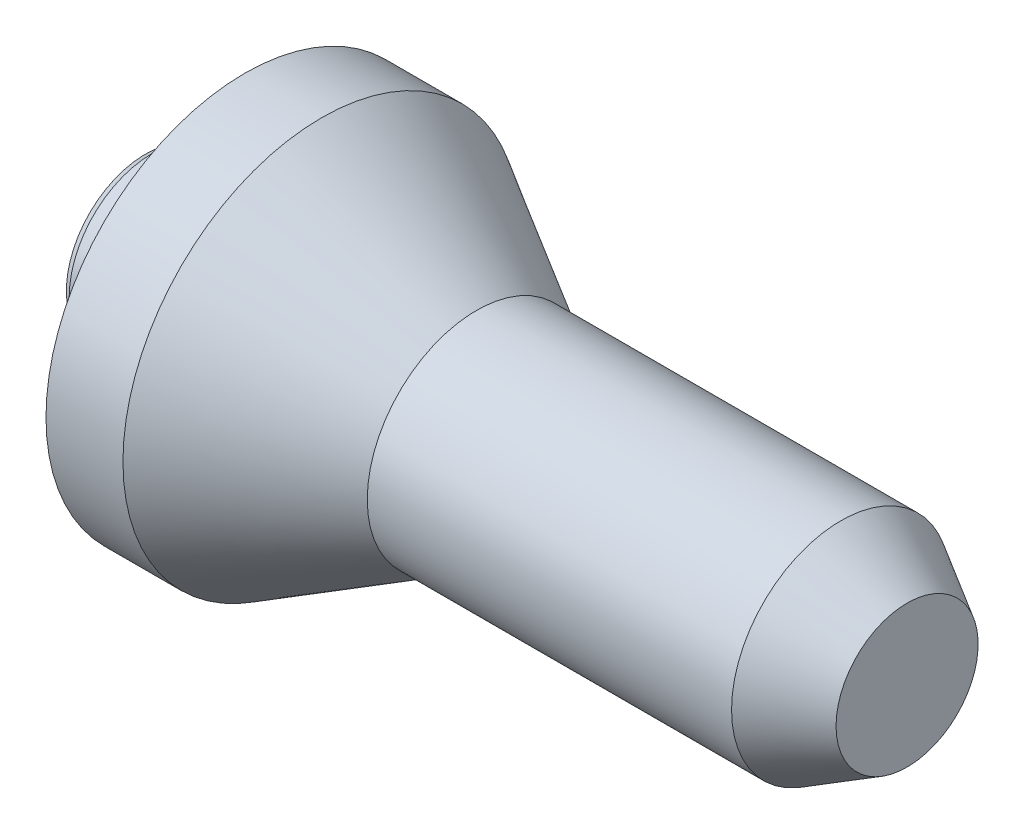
from build123d import *

# Parameters (mm, degrees)
TROU_TARAUD_M16_D           = 14
TROU_TARAUD_M16_DEPTH       = 45
TROU_TARAUD_M16_CSINK_D     = 16.5
TROU_TARAUD_M16_CSINK_ANGLE = 90
TROU_TARAUD_M16_TIP         = 4.206024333
CHANFREIN1_SIZE             = 1
CHANFREIN1_SIZE2            = 0.577350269


with BuildPart() as part:
    # Esquisse1 → R_volution1 (revolve)
    with BuildSketch(Plane.XY, mode=Mode.PRIVATE) as r_volution1_sk:
        Polygon((0, 0), (0, 12.5), (15, 12.5), (15, 30), (26.617314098, 30), (50, 16.5), (105, 16.5), (115, 10.726497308), (115, 0), align=None)
    revolve(r_volution1_sk.sketch.rotate(Axis((-16.465527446, 0, 0), (1, 0, 0)), 90), axis=Axis((-16.465527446, 0, 0), (1, 0, 0)))

    # Trou taraud_ M16
    with Locations(Plane.ZY):
        with Locations((0, 0)):
            CounterSinkHole(TROU_TARAUD_M16_D / 2, TROU_TARAUD_M16_CSINK_D / 2, depth=TROU_TARAUD_M16_DEPTH, counter_sink_angle=TROU_TARAUD_M16_CSINK_ANGLE)
            with Locations((0, 0, -(TROU_TARAUD_M16_DEPTH + TROU_TARAUD_M16_TIP / 2))):  # 118° drill point
                Cone(0, TROU_TARAUD_M16_D / 2, TROU_TARAUD_M16_TIP, mode=Mode.SUBTRACT)

    # Chanfrein1
    chanfrein1_edges = [part.edges().sort_by_distance(p)[0] for p in [
        (0, 0, -12.5),
    ]]
    chanfrein1_side = [part.faces().sort_by_distance(p)[0] for p in [
        (7.5, 0, -12.5),
    ]]
    chamfer(chanfrein1_edges, length=CHANFREIN1_SIZE, length2=CHANFREIN1_SIZE2, reference=chanfrein1_side[0])


solid = part.part
